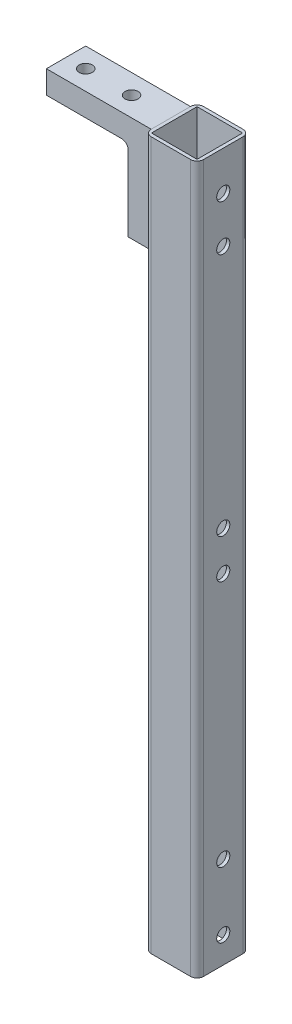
from build123d import *

# Parameters (mm, degrees)
SKETCH2_W                            = 25.4
SKETCH2_H                            = 342.9
BOSS_EXTRUDE1_DEPTH                  = 12.7
SHELL1_T                             = -1.651
FILLET1_R                            = 3.175
BOSS_EXTRUDE2_DEPTH                  = 9.525
FILLET2_R                            = 3.175
F_1_4_0_25_DIAMETER_HOLE1_AT_2_COUNT = 2
F_1_4_0_25_DIAMETER_HOLE1_AT_2_PITCH = 22.225
F_1_4_0_25_DIAMETER_HOLE2_AT_2_COUNT = 2
F_1_4_0_25_DIAMETER_HOLE2_AT_2_PITCH = 22.225
SKETCH8_R                            = 3.175
CUT_EXTRUDE1_DEPTH                   = 53.34
SKETCH9_R                            = 3.175
CUT_EXTRUDE2_DEPTH                   = 38.1
SKETCH10_R                           = 3.175
CUT_EXTRUDE3_DEPTH                   = 50.8


with BuildPart() as part:
    # Sketch2 → Boss-Extrude1 (new, symmetric)
    with BuildSketch(Plane.XY):
        with Locations((12.7, -171.45)):
            Rectangle(SKETCH2_W, SKETCH2_H)
    extrude(amount=BOSS_EXTRUDE1_DEPTH, both=True)

    # Shell1
    shell1_openings = [part.faces().sort_by_distance(p)[0] for p in [
        (12.7, 0, 0),
        (12.7, -342.9, 0),
    ]]
    offset(amount=SHELL1_T, openings=shell1_openings, kind=Kind.INTERSECTION)

    # Fillet1
    fillet1_edges = [part.edges().sort_by_distance(p)[0] for p in [
        (25.4, -171.45, 12.7),
        (0, -171.45, 12.7),
        (25.4, -171.45, -12.7),
        (0, -171.45, -12.7),
    ]]
    fillet(fillet1_edges, radius=FILLET1_R)


with BuildPart() as body_2:
    # Sketch3 → Boss-Extrude2 (new, symmetric)
    with BuildSketch(Plane.XY):
        Polygon((0, -50.8), (0, 0), (-50.8, 0), (-50.8, -11.1252), (-11.1252, -11.1252), (-11.1252, -50.8), align=None)
    extrude(amount=BOSS_EXTRUDE2_DEPTH, both=True)

    # Fillet2
    fillet2_edges = [body_2.edges().sort_by_distance(p)[0] for p in [
        (-11.1252, -11.1252, 0),
    ]]
    fillet(fillet2_edges, radius=FILLET2_R)


with BuildPart() as f_1_4_0_25_diameter_hole1_tool:
    # Sketch4 → 1_4 _0.25_ Diameter Hole1 (revolve)
    with BuildSketch(Plane(origin=(-11.1252, -19.05, 0), x_dir=(0, 0, 1), z_dir=(0, 1, 0))):
        Polygon((0, 0), (0, 20.957732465), (3.175, 19.05), (3.175, 0), align=None)
    f_1_4_0_25_diameter_hole1 = revolve(axis=Axis((-17.4752, -19.05, 0), (1, 0, 0)))


with BuildPart() as part_1:
    add(part.part)

    # 1_4 _0.25_ Diameter Hole1: cut by f_1_4_0_25_diameter_hole1_tool
    add(f_1_4_0_25_diameter_hole1_tool.part, mode=Mode.SUBTRACT)


with BuildPart() as body_2_1:
    add(body_2.part)

    # 1_4 _0.25_ Diameter Hole1: cut by f_1_4_0_25_diameter_hole1_tool
    add(f_1_4_0_25_diameter_hole1_tool.part, mode=Mode.SUBTRACT)


with BuildPart() as f_1_4_0_25_diameter_hole1_at_2_tool:
    # 1_4 _0.25_ Diameter Hole1 at 2: 1_4 _0.25_ Diameter Hole1 ×2
    with Locations(*[(0, -i * F_1_4_0_25_DIAMETER_HOLE1_AT_2_PITCH, 0) for i in range(1, F_1_4_0_25_DIAMETER_HOLE1_AT_2_COUNT)]):
        add(f_1_4_0_25_diameter_hole1)


with BuildPart() as part_2:
    add(part_1.part)

    # 1_4 _0.25_ Diameter Hole1 at 2: cut by f_1_4_0_25_diameter_hole1_at_2_tool
    add(f_1_4_0_25_diameter_hole1_at_2_tool.part, mode=Mode.SUBTRACT)

    # Sketch8 → Cut-Extrude1 (cut)
    with BuildSketch(Plane.ZY.offset(11.1252)):
        with Locations((0, -41.275)):
            Circle(SKETCH8_R)
        with Locations((0, -19.05)):
            Circle(SKETCH8_R)
    extrude(amount=-CUT_EXTRUDE1_DEPTH, mode=Mode.SUBTRACT)

    # Sketch9 → Cut-Extrude2 (cut)
    with BuildSketch(Plane(origin=(0, 0, 0), x_dir=(0, 0, -1), z_dir=(1, 0, 0))):
        with Locations(Location((0, -159.5374, 0), (0, 0, 180))):
            Circle(SKETCH9_R)
        with Locations(Location((0, -178.5874, 0), (0, 0, 180))):
            Circle(SKETCH9_R)
    extrude(amount=CUT_EXTRUDE2_DEPTH, mode=Mode.SUBTRACT)

    # Sketch10 → Cut-Extrude3 (cut)
    with BuildSketch(Plane(origin=(0, 0, 0), x_dir=(0, 0, -1), z_dir=(1, 0, 0))):
        with Locations(Location((0, -298.45, 0), (0, 0, 270))):
            Circle(SKETCH10_R)
        with Locations(Location((0, -330.2, 0), (0, 0, 270))):
            Circle(SKETCH10_R)
    extrude(amount=CUT_EXTRUDE3_DEPTH, mode=Mode.SUBTRACT)


with BuildPart() as body_2_2:
    add(body_2_1.part)

    # 1_4 _0.25_ Diameter Hole1 at 2: cut by f_1_4_0_25_diameter_hole1_at_2_tool
    add(f_1_4_0_25_diameter_hole1_at_2_tool.part, mode=Mode.SUBTRACT)

    # Sketch6 → 1_4 _0.25_ Diameter Hole2 (revolve, cut)
    with BuildSketch(Plane(origin=(-41.275, -11.1252, 0), x_dir=(0, 0, -1), z_dir=(1, 0, 0))):
        Polygon((0, 0), (0, 20.957732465), (3.175, 19.05), (3.175, 0), align=None)
    f_1_4_0_25_diameter_hole2 = revolve(axis=Axis((-41.275, -17.4752, 0), (0, 1, 0)), mode=Mode.SUBTRACT)

    # 1_4 _0.25_ Diameter Hole2 at 2: 1_4 _0.25_ Diameter Hole2 ×2
    with Locations(*[(i * F_1_4_0_25_DIAMETER_HOLE2_AT_2_PITCH, 0, 0) for i in range(1, F_1_4_0_25_DIAMETER_HOLE2_AT_2_COUNT)]):
        add(f_1_4_0_25_diameter_hole2, mode=Mode.SUBTRACT)


solid = Compound([part_2.part, body_2_2.part])
